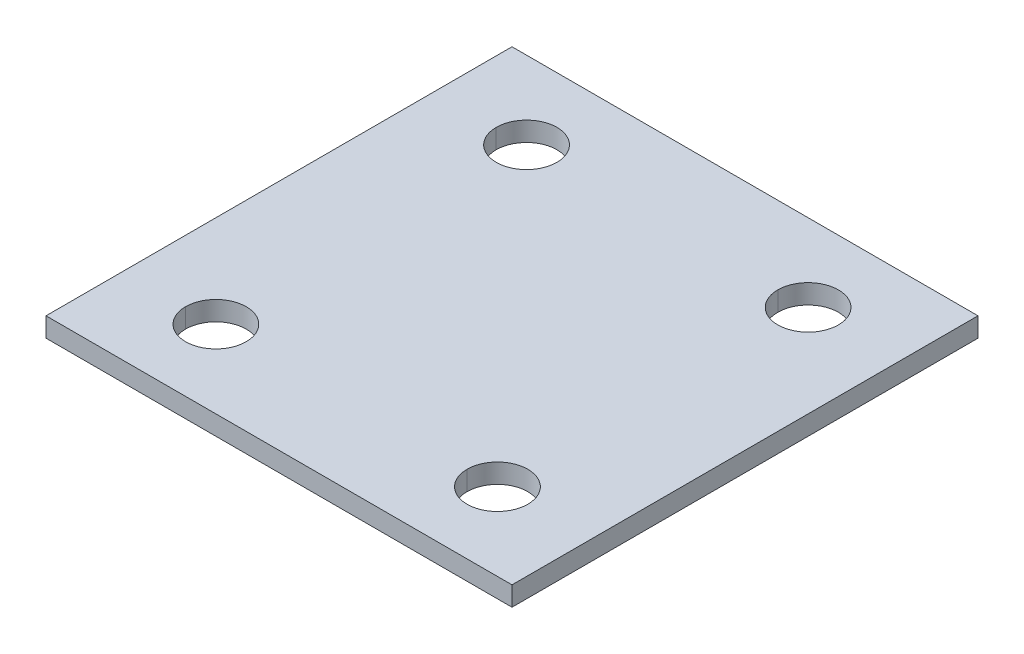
ISO-10303-21;
HEADER;
FILE_DESCRIPTION(('STEP AP214'),'2;1');
FILE_NAME('part.step','',(''),(''),'','','');
FILE_SCHEMA(('AUTOMOTIVE_DESIGN { 1 0 10303 214 1 1 1 1 }'));
ENDSEC;
DATA;
#1=APPLICATION_CONTEXT('core data for automotive mechanical design processes');
#2=APPLICATION_PROTOCOL_DEFINITION('international standard','automotive_design',2000,#1);
#3=PRODUCT_CONTEXT('',#1,'mechanical');
#4=PRODUCT('Part','Part','',(#3));
#5=PRODUCT_RELATED_PRODUCT_CATEGORY('part','',(#4));
#6=PRODUCT_DEFINITION_FORMATION('','',#4);
#7=PRODUCT_DEFINITION_CONTEXT('part definition',#1,'design');
#8=PRODUCT_DEFINITION('design','',#6,#7);
#9=PRODUCT_DEFINITION_SHAPE('','',#8);
#10=(LENGTH_UNIT() NAMED_UNIT(*) SI_UNIT(.MILLI.,.METRE.));
#11=(NAMED_UNIT(*) PLANE_ANGLE_UNIT() SI_UNIT($,.RADIAN.));
#12=(NAMED_UNIT(*) SI_UNIT($,.STERADIAN.) SOLID_ANGLE_UNIT());
#13=UNCERTAINTY_MEASURE_WITH_UNIT(LENGTH_MEASURE(1.E-05),#10,'distance_accuracy_value','');
#14=(GEOMETRIC_REPRESENTATION_CONTEXT(3) GLOBAL_UNCERTAINTY_ASSIGNED_CONTEXT((#13)) GLOBAL_UNIT_ASSIGNED_CONTEXT((#10,
#11,#12)) REPRESENTATION_CONTEXT('',''));
#15=CARTESIAN_POINT('',(0.,0.,0.));
#16=DIRECTION('',(0.,0.,1.));
#17=DIRECTION('',(1.,0.,0.));
#18=AXIS2_PLACEMENT_3D('',#15,#16,#17);
#19=CARTESIAN_POINT('',(-38.1,1.5875,38.1));
#20=DIRECTION('',(0.,1.,0.));
#21=DIRECTION('',(0.,0.,1.));
#22=AXIS2_PLACEMENT_3D('',#19,#20,#21);
#23=PLANE('',#22);
#24=DIRECTION('',(0.,0.,-1.));
#25=VECTOR('',#24,1.);
#26=CARTESIAN_POINT('',(38.1,1.5875,-38.1));
#27=LINE('',#26,#25);
#28=CARTESIAN_POINT('',(38.1,1.5875,-38.1));
#29=VERTEX_POINT('',#28);
#30=CARTESIAN_POINT('',(38.1,1.5875,38.1));
#31=VERTEX_POINT('',#30);
#32=EDGE_CURVE('E228',#29,#31,#27,.F.);
#33=ORIENTED_EDGE('',*,*,#32,.F.);
#34=DIRECTION('',(-1.,0.,0.));
#35=VECTOR('',#34,1.);
#36=CARTESIAN_POINT('',(-38.1,1.5875,-38.1));
#37=LINE('',#36,#35);
#38=CARTESIAN_POINT('',(-38.1,1.5875,-38.1));
#39=VERTEX_POINT('',#38);
#40=EDGE_CURVE('E250',#39,#29,#37,.F.);
#41=ORIENTED_EDGE('',*,*,#40,.F.);
#42=DIRECTION('',(0.,0.,1.));
#43=VECTOR('',#42,1.);
#44=CARTESIAN_POINT('',(-38.1,1.5875,38.1));
#45=LINE('',#44,#43);
#46=CARTESIAN_POINT('',(-38.1,1.5875,38.1));
#47=VERTEX_POINT('',#46);
#48=EDGE_CURVE('E254',#47,#39,#45,.F.);
#49=ORIENTED_EDGE('',*,*,#48,.F.);
#50=DIRECTION('',(1.,0.,0.));
#51=VECTOR('',#50,1.);
#52=CARTESIAN_POINT('',(38.1,1.5875,38.1));
#53=LINE('',#52,#51);
#54=EDGE_CURVE('E258',#31,#47,#53,.F.);
#55=ORIENTED_EDGE('',*,*,#54,.F.);
#56=EDGE_LOOP('',(#33,#41,#49,#55));
#57=FACE_BOUND('',#56,.T.);
#58=CARTESIAN_POINT('',(-23.01875,1.5875,-25.4));
#59=DIRECTION('',(0.,1.,0.));
#60=DIRECTION('',(0.,0.,1.));
#61=AXIS2_PLACEMENT_3D('',#58,#59,#60);
#62=CIRCLE('',#61,4.9609375);
#63=CARTESIAN_POINT('',(-27.9796875,1.5875,-25.4));
#64=VERTEX_POINT('',#63);
#65=CARTESIAN_POINT('',(-18.0578125,1.5875,-25.4));
#66=VERTEX_POINT('',#65);
#67=EDGE_CURVE('E148',#64,#66,#62,.F.);
#68=ORIENTED_EDGE('',*,*,#67,.T.);
#69=CARTESIAN_POINT('',(-23.01875,1.5875,-25.4));
#70=DIRECTION('',(0.,1.,0.));
#71=DIRECTION('',(0.,0.,1.));
#72=AXIS2_PLACEMENT_3D('',#69,#70,#71);
#73=CIRCLE('',#72,4.9609375);
#74=EDGE_CURVE('E143',#66,#64,#73,.F.);
#75=ORIENTED_EDGE('',*,*,#74,.T.);
#76=EDGE_LOOP('',(#68,#75));
#77=FACE_BOUND('',#76,.T.);
#78=CARTESIAN_POINT('',(-23.01875,1.5875,25.4));
#79=DIRECTION('',(0.,1.,0.));
#80=DIRECTION('',(0.,0.,1.));
#81=AXIS2_PLACEMENT_3D('',#78,#79,#80);
#82=CIRCLE('',#81,4.9609375);
#83=CARTESIAN_POINT('',(-27.9796875,1.5875,25.4));
#84=VERTEX_POINT('',#83);
#85=CARTESIAN_POINT('',(-18.0578125,1.5875,25.4));
#86=VERTEX_POINT('',#85);
#87=EDGE_CURVE('E155',#84,#86,#82,.F.);
#88=ORIENTED_EDGE('',*,*,#87,.T.);
#89=CARTESIAN_POINT('',(-23.01875,1.5875,25.4));
#90=DIRECTION('',(0.,1.,0.));
#91=DIRECTION('',(0.,0.,1.));
#92=AXIS2_PLACEMENT_3D('',#89,#90,#91);
#93=CIRCLE('',#92,4.9609375);
#94=EDGE_CURVE('E151',#86,#84,#93,.F.);
#95=ORIENTED_EDGE('',*,*,#94,.T.);
#96=EDGE_LOOP('',(#88,#95));
#97=FACE_BOUND('',#96,.T.);
#98=CARTESIAN_POINT('',(23.01875,1.5875,25.4));
#99=DIRECTION('',(0.,1.,0.));
#100=DIRECTION('',(0.,0.,1.));
#101=AXIS2_PLACEMENT_3D('',#98,#99,#100);
#102=CIRCLE('',#101,4.9609375);
#103=CARTESIAN_POINT('',(18.0578125,1.5875,25.4));
#104=VERTEX_POINT('',#103);
#105=CARTESIAN_POINT('',(27.9796875,1.5875,25.4));
#106=VERTEX_POINT('',#105);
#107=EDGE_CURVE('E162',#104,#106,#102,.F.);
#108=ORIENTED_EDGE('',*,*,#107,.T.);
#109=CARTESIAN_POINT('',(23.01875,1.5875,25.4));
#110=DIRECTION('',(0.,1.,0.));
#111=DIRECTION('',(0.,0.,1.));
#112=AXIS2_PLACEMENT_3D('',#109,#110,#111);
#113=CIRCLE('',#112,4.9609375);
#114=EDGE_CURVE('E158',#106,#104,#113,.F.);
#115=ORIENTED_EDGE('',*,*,#114,.T.);
#116=EDGE_LOOP('',(#108,#115));
#117=FACE_BOUND('',#116,.T.);
#118=CARTESIAN_POINT('',(23.01875,1.5875,-25.4));
#119=DIRECTION('',(0.,1.,0.));
#120=DIRECTION('',(0.,0.,1.));
#121=AXIS2_PLACEMENT_3D('',#118,#119,#120);
#122=CIRCLE('',#121,4.9609375);
#123=CARTESIAN_POINT('',(18.0578125,1.5875,-25.4));
#124=VERTEX_POINT('',#123);
#125=CARTESIAN_POINT('',(27.9796875,1.5875,-25.4));
#126=VERTEX_POINT('',#125);
#127=EDGE_CURVE('E19',#124,#126,#122,.F.);
#128=ORIENTED_EDGE('',*,*,#127,.T.);
#129=CARTESIAN_POINT('',(23.01875,1.5875,-25.4));
#130=DIRECTION('',(0.,1.,0.));
#131=DIRECTION('',(0.,0.,1.));
#132=AXIS2_PLACEMENT_3D('',#129,#130,#131);
#133=CIRCLE('',#132,4.9609375);
#134=EDGE_CURVE('E106',#126,#124,#133,.F.);
#135=ORIENTED_EDGE('',*,*,#134,.T.);
#136=EDGE_LOOP('',(#128,#135));
#137=FACE_BOUND('',#136,.T.);
#138=ADVANCED_FACE('F16',(#57,#77,#97,#117,#137),#23,.T.);
#139=CARTESIAN_POINT('',(23.01875,-1.5875,-25.4));
#140=DIRECTION('',(0.,1.,0.));
#141=DIRECTION('',(0.,0.,1.));
#142=AXIS2_PLACEMENT_3D('',#139,#140,#141);
#143=CYLINDRICAL_SURFACE('',#142,4.9609375);
#144=CARTESIAN_POINT('',(23.01875,-1.5875,-25.4));
#145=DIRECTION('',(0.,1.,0.));
#146=DIRECTION('',(0.,0.,1.));
#147=AXIS2_PLACEMENT_3D('',#144,#145,#146);
#148=CIRCLE('',#147,4.9609375);
#149=CARTESIAN_POINT('',(18.0578125,-1.5875,-25.4));
#150=VERTEX_POINT('',#149);
#151=CARTESIAN_POINT('',(27.9796875,-1.5875,-25.4));
#152=VERTEX_POINT('',#151);
#153=EDGE_CURVE('E115',#150,#152,#148,.F.);
#154=ORIENTED_EDGE('',*,*,#153,.T.);
#155=DIRECTION('',(0.,1.,0.));
#156=VECTOR('',#155,1.);
#157=CARTESIAN_POINT('',(27.9796875,-1.5875,-25.4));
#158=LINE('',#157,#156);
#159=EDGE_CURVE('E107',#152,#126,#158,.T.);
#160=ORIENTED_EDGE('',*,*,#159,.T.);
#161=ORIENTED_EDGE('',*,*,#127,.F.);
#162=DIRECTION('',(0.,1.,0.));
#163=VECTOR('',#162,1.);
#164=CARTESIAN_POINT('',(18.0578125,-1.5875,-25.4));
#165=LINE('',#164,#163);
#166=EDGE_CURVE('E112',#124,#150,#165,.F.);
#167=ORIENTED_EDGE('',*,*,#166,.T.);
#168=EDGE_LOOP('',(#154,#160,#161,#167));
#169=FACE_BOUND('',#168,.T.);
#170=ADVANCED_FACE('F114',(#169),#143,.F.);
#171=CARTESIAN_POINT('',(23.01875,-1.5875,-25.4));
#172=DIRECTION('',(0.,1.,0.));
#173=DIRECTION('',(0.,0.,1.));
#174=AXIS2_PLACEMENT_3D('',#171,#172,#173);
#175=CYLINDRICAL_SURFACE('',#174,4.9609375);
#176=ORIENTED_EDGE('',*,*,#134,.F.);
#177=ORIENTED_EDGE('',*,*,#159,.F.);
#178=CARTESIAN_POINT('',(23.01875,-1.5875,-25.4));
#179=DIRECTION('',(0.,1.,0.));
#180=DIRECTION('',(0.,0.,1.));
#181=AXIS2_PLACEMENT_3D('',#178,#179,#180);
#182=CIRCLE('',#181,4.9609375);
#183=EDGE_CURVE('E139',#152,#150,#182,.F.);
#184=ORIENTED_EDGE('',*,*,#183,.T.);
#185=ORIENTED_EDGE('',*,*,#166,.F.);
#186=EDGE_LOOP('',(#176,#177,#184,#185));
#187=FACE_BOUND('',#186,.T.);
#188=ADVANCED_FACE('F109',(#187),#175,.F.);
#189=CARTESIAN_POINT('',(23.01875,-1.5875,25.4));
#190=DIRECTION('',(0.,1.,0.));
#191=DIRECTION('',(0.,0.,1.));
#192=AXIS2_PLACEMENT_3D('',#189,#190,#191);
#193=CYLINDRICAL_SURFACE('',#192,4.9609375);
#194=CARTESIAN_POINT('',(23.01875,-1.5875,25.4));
#195=DIRECTION('',(0.,1.,0.));
#196=DIRECTION('',(0.,0.,1.));
#197=AXIS2_PLACEMENT_3D('',#194,#195,#196);
#198=CIRCLE('',#197,4.9609375);
#199=CARTESIAN_POINT('',(18.0578125,-1.5875,25.4));
#200=VERTEX_POINT('',#199);
#201=CARTESIAN_POINT('',(27.9796875,-1.5875,25.4));
#202=VERTEX_POINT('',#201);
#203=EDGE_CURVE('E136',#200,#202,#198,.F.);
#204=ORIENTED_EDGE('',*,*,#203,.T.);
#205=DIRECTION('',(0.,1.,0.));
#206=VECTOR('',#205,1.);
#207=CARTESIAN_POINT('',(27.9796875,-1.5875,25.4));
#208=LINE('',#207,#206);
#209=EDGE_CURVE('E161',#202,#106,#208,.T.);
#210=ORIENTED_EDGE('',*,*,#209,.T.);
#211=ORIENTED_EDGE('',*,*,#107,.F.);
#212=DIRECTION('',(0.,1.,0.));
#213=VECTOR('',#212,1.);
#214=CARTESIAN_POINT('',(18.0578125,-1.5875,25.4));
#215=LINE('',#214,#213);
#216=EDGE_CURVE('E157',#104,#200,#215,.F.);
#217=ORIENTED_EDGE('',*,*,#216,.T.);
#218=EDGE_LOOP('',(#204,#210,#211,#217));
#219=FACE_BOUND('',#218,.T.);
#220=ADVANCED_FACE('F211',(#219),#193,.F.);
#221=CARTESIAN_POINT('',(23.01875,-1.5875,25.4));
#222=DIRECTION('',(0.,1.,0.));
#223=DIRECTION('',(0.,0.,1.));
#224=AXIS2_PLACEMENT_3D('',#221,#222,#223);
#225=CYLINDRICAL_SURFACE('',#224,4.9609375);
#226=ORIENTED_EDGE('',*,*,#114,.F.);
#227=ORIENTED_EDGE('',*,*,#209,.F.);
#228=CARTESIAN_POINT('',(23.01875,-1.5875,25.4));
#229=DIRECTION('',(0.,1.,0.));
#230=DIRECTION('',(0.,0.,1.));
#231=AXIS2_PLACEMENT_3D('',#228,#229,#230);
#232=CIRCLE('',#231,4.9609375);
#233=EDGE_CURVE('E133',#202,#200,#232,.F.);
#234=ORIENTED_EDGE('',*,*,#233,.T.);
#235=ORIENTED_EDGE('',*,*,#216,.F.);
#236=EDGE_LOOP('',(#226,#227,#234,#235));
#237=FACE_BOUND('',#236,.T.);
#238=ADVANCED_FACE('F207',(#237),#225,.F.);
#239=CARTESIAN_POINT('',(-23.01875,-1.5875,25.4));
#240=DIRECTION('',(0.,1.,0.));
#241=DIRECTION('',(0.,0.,1.));
#242=AXIS2_PLACEMENT_3D('',#239,#240,#241);
#243=CYLINDRICAL_SURFACE('',#242,4.9609375);
#244=CARTESIAN_POINT('',(-23.01875,-1.5875,25.4));
#245=DIRECTION('',(0.,1.,0.));
#246=DIRECTION('',(0.,0.,1.));
#247=AXIS2_PLACEMENT_3D('',#244,#245,#246);
#248=CIRCLE('',#247,4.9609375);
#249=CARTESIAN_POINT('',(-27.9796875,-1.5875,25.4));
#250=VERTEX_POINT('',#249);
#251=CARTESIAN_POINT('',(-18.0578125,-1.5875,25.4));
#252=VERTEX_POINT('',#251);
#253=EDGE_CURVE('E130',#250,#252,#248,.F.);
#254=ORIENTED_EDGE('',*,*,#253,.T.);
#255=DIRECTION('',(0.,1.,0.));
#256=VECTOR('',#255,1.);
#257=CARTESIAN_POINT('',(-18.0578125,-1.5875,25.4));
#258=LINE('',#257,#256);
#259=EDGE_CURVE('E154',#252,#86,#258,.T.);
#260=ORIENTED_EDGE('',*,*,#259,.T.);
#261=ORIENTED_EDGE('',*,*,#87,.F.);
#262=DIRECTION('',(0.,1.,0.));
#263=VECTOR('',#262,1.);
#264=CARTESIAN_POINT('',(-27.9796875,-1.5875,25.4));
#265=LINE('',#264,#263);
#266=EDGE_CURVE('E150',#84,#250,#265,.F.);
#267=ORIENTED_EDGE('',*,*,#266,.T.);
#268=EDGE_LOOP('',(#254,#260,#261,#267));
#269=FACE_BOUND('',#268,.T.);
#270=ADVANCED_FACE('F203',(#269),#243,.F.);
#271=CARTESIAN_POINT('',(-23.01875,-1.5875,25.4));
#272=DIRECTION('',(0.,1.,0.));
#273=DIRECTION('',(0.,0.,1.));
#274=AXIS2_PLACEMENT_3D('',#271,#272,#273);
#275=CYLINDRICAL_SURFACE('',#274,4.9609375);
#276=ORIENTED_EDGE('',*,*,#94,.F.);
#277=ORIENTED_EDGE('',*,*,#259,.F.);
#278=CARTESIAN_POINT('',(-23.01875,-1.5875,25.4));
#279=DIRECTION('',(0.,1.,0.));
#280=DIRECTION('',(0.,0.,1.));
#281=AXIS2_PLACEMENT_3D('',#278,#279,#280);
#282=CIRCLE('',#281,4.9609375);
#283=EDGE_CURVE('E127',#252,#250,#282,.F.);
#284=ORIENTED_EDGE('',*,*,#283,.T.);
#285=ORIENTED_EDGE('',*,*,#266,.F.);
#286=EDGE_LOOP('',(#276,#277,#284,#285));
#287=FACE_BOUND('',#286,.T.);
#288=ADVANCED_FACE('F199',(#287),#275,.F.);
#289=CARTESIAN_POINT('',(-23.01875,-1.5875,-25.4));
#290=DIRECTION('',(0.,1.,0.));
#291=DIRECTION('',(0.,0.,1.));
#292=AXIS2_PLACEMENT_3D('',#289,#290,#291);
#293=CYLINDRICAL_SURFACE('',#292,4.9609375);
#294=CARTESIAN_POINT('',(-23.01875,-1.5875,-25.4));
#295=DIRECTION('',(0.,1.,0.));
#296=DIRECTION('',(0.,0.,1.));
#297=AXIS2_PLACEMENT_3D('',#294,#295,#296);
#298=CIRCLE('',#297,4.9609375);
#299=CARTESIAN_POINT('',(-27.9796875,-1.5875,-25.4));
#300=VERTEX_POINT('',#299);
#301=CARTESIAN_POINT('',(-18.0578125,-1.5875,-25.4));
#302=VERTEX_POINT('',#301);
#303=EDGE_CURVE('E124',#300,#302,#298,.F.);
#304=ORIENTED_EDGE('',*,*,#303,.T.);
#305=DIRECTION('',(0.,1.,0.));
#306=VECTOR('',#305,1.);
#307=CARTESIAN_POINT('',(-18.0578125,-1.5875,-25.4));
#308=LINE('',#307,#306);
#309=EDGE_CURVE('E147',#302,#66,#308,.T.);
#310=ORIENTED_EDGE('',*,*,#309,.T.);
#311=ORIENTED_EDGE('',*,*,#67,.F.);
#312=DIRECTION('',(0.,1.,0.));
#313=VECTOR('',#312,1.);
#314=CARTESIAN_POINT('',(-27.9796875,-1.5875,-25.4));
#315=LINE('',#314,#313);
#316=EDGE_CURVE('E146',#64,#300,#315,.F.);
#317=ORIENTED_EDGE('',*,*,#316,.T.);
#318=EDGE_LOOP('',(#304,#310,#311,#317));
#319=FACE_BOUND('',#318,.T.);
#320=ADVANCED_FACE('F195',(#319),#293,.F.);
#321=CARTESIAN_POINT('',(-23.01875,-1.5875,-25.4));
#322=DIRECTION('',(0.,1.,0.));
#323=DIRECTION('',(0.,0.,1.));
#324=AXIS2_PLACEMENT_3D('',#321,#322,#323);
#325=CYLINDRICAL_SURFACE('',#324,4.9609375);
#326=ORIENTED_EDGE('',*,*,#74,.F.);
#327=ORIENTED_EDGE('',*,*,#309,.F.);
#328=CARTESIAN_POINT('',(-23.01875,-1.5875,-25.4));
#329=DIRECTION('',(0.,1.,0.));
#330=DIRECTION('',(0.,0.,1.));
#331=AXIS2_PLACEMENT_3D('',#328,#329,#330);
#332=CIRCLE('',#331,4.9609375);
#333=EDGE_CURVE('E120',#302,#300,#332,.F.);
#334=ORIENTED_EDGE('',*,*,#333,.T.);
#335=ORIENTED_EDGE('',*,*,#316,.F.);
#336=EDGE_LOOP('',(#326,#327,#334,#335));
#337=FACE_BOUND('',#336,.T.);
#338=ADVANCED_FACE('F191',(#337),#325,.F.);
#339=CARTESIAN_POINT('',(38.1,-1.5875,-38.1));
#340=DIRECTION('',(1.,0.,0.));
#341=DIRECTION('',(0.,0.,-1.));
#342=AXIS2_PLACEMENT_3D('',#339,#340,#341);
#343=PLANE('',#342);
#344=DIRECTION('',(0.,0.,1.));
#345=VECTOR('',#344,1.);
#346=CARTESIAN_POINT('',(38.1,-1.5875,0.));
#347=LINE('',#346,#345);
#348=CARTESIAN_POINT('',(38.1,-1.5875,38.1));
#349=VERTEX_POINT('',#348);
#350=CARTESIAN_POINT('',(38.1,-1.5875,-38.1));
#351=VERTEX_POINT('',#350);
#352=EDGE_CURVE('E123',#349,#351,#347,.F.);
#353=ORIENTED_EDGE('',*,*,#352,.T.);
#354=DIRECTION('',(0.,1.,0.));
#355=VECTOR('',#354,1.);
#356=CARTESIAN_POINT('',(38.1,-1.5875,-38.1));
#357=LINE('',#356,#355);
#358=EDGE_CURVE('E252',#29,#351,#357,.F.);
#359=ORIENTED_EDGE('',*,*,#358,.F.);
#360=ORIENTED_EDGE('',*,*,#32,.T.);
#361=DIRECTION('',(0.,1.,0.));
#362=VECTOR('',#361,1.);
#363=CARTESIAN_POINT('',(38.1,-1.5875,38.1));
#364=LINE('',#363,#362);
#365=EDGE_CURVE('E142',#349,#31,#364,.T.);
#366=ORIENTED_EDGE('',*,*,#365,.F.);
#367=EDGE_LOOP('',(#353,#359,#360,#366));
#368=FACE_BOUND('',#367,.T.);
#369=ADVANCED_FACE('F187',(#368),#343,.T.);
#370=CARTESIAN_POINT('',(-38.1,-1.5875,-38.1));
#371=DIRECTION('',(0.,0.,-1.));
#372=DIRECTION('',(-1.,0.,0.));
#373=AXIS2_PLACEMENT_3D('',#370,#371,#372);
#374=PLANE('',#373);
#375=DIRECTION('',(1.,0.,0.));
#376=VECTOR('',#375,1.);
#377=CARTESIAN_POINT('',(0.,-1.5875,-38.1));
#378=LINE('',#377,#376);
#379=CARTESIAN_POINT('',(-38.1,-1.5875,-38.1));
#380=VERTEX_POINT('',#379);
#381=EDGE_CURVE('E265',#351,#380,#378,.F.);
#382=ORIENTED_EDGE('',*,*,#381,.T.);
#383=DIRECTION('',(0.,1.,0.));
#384=VECTOR('',#383,1.);
#385=CARTESIAN_POINT('',(-38.1,-1.5875,-38.1));
#386=LINE('',#385,#384);
#387=EDGE_CURVE('E256',#39,#380,#386,.F.);
#388=ORIENTED_EDGE('',*,*,#387,.F.);
#389=ORIENTED_EDGE('',*,*,#40,.T.);
#390=ORIENTED_EDGE('',*,*,#358,.T.);
#391=EDGE_LOOP('',(#382,#388,#389,#390));
#392=FACE_BOUND('',#391,.T.);
#393=ADVANCED_FACE('F183',(#392),#374,.T.);
#394=CARTESIAN_POINT('',(-38.1,-1.5875,38.1));
#395=DIRECTION('',(-1.,0.,0.));
#396=DIRECTION('',(0.,0.,1.));
#397=AXIS2_PLACEMENT_3D('',#394,#395,#396);
#398=PLANE('',#397);
#399=DIRECTION('',(0.,0.,1.));
#400=VECTOR('',#399,1.);
#401=CARTESIAN_POINT('',(-38.1,-1.5875,0.));
#402=LINE('',#401,#400);
#403=CARTESIAN_POINT('',(-38.1,-1.5875,38.1));
#404=VERTEX_POINT('',#403);
#405=EDGE_CURVE('E25',#380,#404,#402,.T.);
#406=ORIENTED_EDGE('',*,*,#405,.T.);
#407=DIRECTION('',(0.,1.,0.));
#408=VECTOR('',#407,1.);
#409=CARTESIAN_POINT('',(-38.1,-1.5875,38.1));
#410=LINE('',#409,#408);
#411=EDGE_CURVE('E33',#47,#404,#410,.F.);
#412=ORIENTED_EDGE('',*,*,#411,.F.);
#413=ORIENTED_EDGE('',*,*,#48,.T.);
#414=ORIENTED_EDGE('',*,*,#387,.T.);
#415=EDGE_LOOP('',(#406,#412,#413,#414));
#416=FACE_BOUND('',#415,.T.);
#417=ADVANCED_FACE('F176',(#416),#398,.T.);
#418=CARTESIAN_POINT('',(38.1,-1.5875,38.1));
#419=DIRECTION('',(0.,0.,1.));
#420=DIRECTION('',(1.,0.,0.));
#421=AXIS2_PLACEMENT_3D('',#418,#419,#420);
#422=PLANE('',#421);
#423=DIRECTION('',(1.,0.,0.));
#424=VECTOR('',#423,1.);
#425=CARTESIAN_POINT('',(0.,-1.5875,38.1));
#426=LINE('',#425,#424);
#427=EDGE_CURVE('E11',#404,#349,#426,.T.);
#428=ORIENTED_EDGE('',*,*,#427,.T.);
#429=ORIENTED_EDGE('',*,*,#365,.T.);
#430=ORIENTED_EDGE('',*,*,#54,.T.);
#431=ORIENTED_EDGE('',*,*,#411,.T.);
#432=EDGE_LOOP('',(#428,#429,#430,#431));
#433=FACE_BOUND('',#432,.T.);
#434=ADVANCED_FACE('F169',(#433),#422,.T.);
#435=CARTESIAN_POINT('',(0.,-1.5875,0.));
#436=DIRECTION('',(0.,1.,0.));
#437=DIRECTION('',(0.,0.,1.));
#438=AXIS2_PLACEMENT_3D('',#435,#436,#437);
#439=PLANE('',#438);
#440=ORIENTED_EDGE('',*,*,#405,.F.);
#441=ORIENTED_EDGE('',*,*,#381,.F.);
#442=ORIENTED_EDGE('',*,*,#352,.F.);
#443=ORIENTED_EDGE('',*,*,#427,.F.);
#444=EDGE_LOOP('',(#440,#441,#442,#443));
#445=FACE_BOUND('',#444,.T.);
#446=ORIENTED_EDGE('',*,*,#303,.F.);
#447=ORIENTED_EDGE('',*,*,#333,.F.);
#448=EDGE_LOOP('',(#446,#447));
#449=FACE_BOUND('',#448,.T.);
#450=ORIENTED_EDGE('',*,*,#253,.F.);
#451=ORIENTED_EDGE('',*,*,#283,.F.);
#452=EDGE_LOOP('',(#450,#451));
#453=FACE_BOUND('',#452,.T.);
#454=ORIENTED_EDGE('',*,*,#203,.F.);
#455=ORIENTED_EDGE('',*,*,#233,.F.);
#456=EDGE_LOOP('',(#454,#455));
#457=FACE_BOUND('',#456,.T.);
#458=ORIENTED_EDGE('',*,*,#153,.F.);
#459=ORIENTED_EDGE('',*,*,#183,.F.);
#460=EDGE_LOOP('',(#458,#459));
#461=FACE_BOUND('',#460,.T.);
#462=ADVANCED_FACE('F167',(#445,#449,#453,#457,#461),#439,.F.);
#463=CLOSED_SHELL('',(#138,#170,#188,#220,#238,#270,#288,#320,#338,#369,#393,#417,#434,#462));
#464=MANIFOLD_SOLID_BREP('B1',#463);
#465=ADVANCED_BREP_SHAPE_REPRESENTATION('',(#18,#464),#14);
#466=SHAPE_DEFINITION_REPRESENTATION(#9,#465);
ENDSEC;
END-ISO-10303-21;
